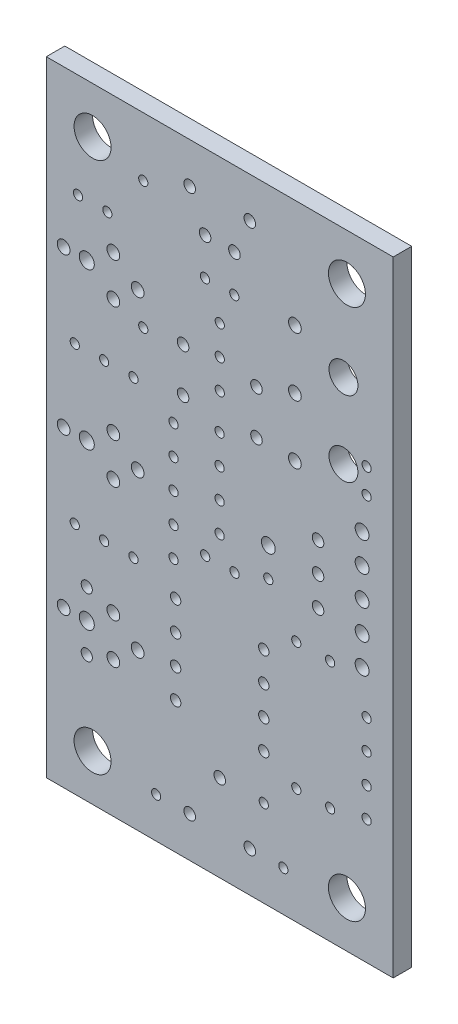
from build123d import *

# Parameters (mm, degrees)
ESQUISSE1_W      = 29.99994
ESQUISSE1_H      = 54.0004
ESQUISSE1_R      = 0.50038
ESQUISSE1_R_2    = 0.4826
ESQUISSE1_R_3    = 0.39878
ESQUISSE1_R_4    = 0.55118
ESQUISSE1_R_5    = 0.65024
ESQUISSE1_R_6    = 1.6002
ESQUISSE1_R_7    = 0.44958
ESQUISSE1_R_8    = 1.24968
ESQUISSE1_R_9    = 0.59944
ESQUISSE1_R_10   = 0.5
ESQUISSE1_R_11   = 0.4
EXTRUSION1_DEPTH = 1.6


with BuildPart() as part:
    # Esquisse1 → Extrusion1 (new body)
    with BuildSketch(Plane.XY):
        with Locations((14.99997, 27.0002)):
            Rectangle(ESQUISSE1_W, ESQUISSE1_H)
        with Locations((18.17624, 38.36416)):
            Circle(ESQUISSE1_R, mode=Mode.SUBTRACT)
        with Locations((18.17624, 34.55416)):
            Circle(ESQUISSE1_R, mode=Mode.SUBTRACT)
        with Locations((11.82624, 34.55416)):
            Circle(ESQUISSE1_R, mode=Mode.SUBTRACT)
        with Locations((11.82624, 38.36416)):
            Circle(ESQUISSE1_R, mode=Mode.SUBTRACT)
        with Locations((17.59966, 3.50012)):
            Circle(ESQUISSE1_R, mode=Mode.SUBTRACT)
        with Locations((12.40028, 3.50012)):
            Circle(ESQUISSE1_R, mode=Mode.SUBTRACT)
        with Locations((12.40028, 50.50028)):
            Circle(ESQUISSE1_R, mode=Mode.SUBTRACT)
        with Locations((17.59966, 50.50028)):
            Circle(ESQUISSE1_R, mode=Mode.SUBTRACT)
        with Locations((3.50012, 10.9601)):
            Circle(ESQUISSE1_R_2, mode=Mode.SUBTRACT)
        with Locations((3.50012, 16.0401)):
            Circle(ESQUISSE1_R_2, mode=Mode.SUBTRACT)
        with Locations((14.98854, 30.82036)):
            Circle(ESQUISSE1_R_3, mode=Mode.SUBTRACT)
        with Locations((14.98854, 33.36036)):
            Circle(ESQUISSE1_R_3, mode=Mode.SUBTRACT)
        with Locations((16.27124, 47.50054)):
            Circle(ESQUISSE1_R, mode=Mode.SUBTRACT)
        with Locations((13.73124, 47.50054)):
            Circle(ESQUISSE1_R, mode=Mode.SUBTRACT)
        with Locations((27.70124, 13.28928)):
            Circle(ESQUISSE1_R_3, mode=Mode.SUBTRACT)
        with Locations((27.70124, 10.74928)):
            Circle(ESQUISSE1_R_3, mode=Mode.SUBTRACT)
        with Locations((1.4986, 13.5001)):
            Circle(ESQUISSE1_R_4, mode=Mode.SUBTRACT)
        with Locations((7.8994, 13.5001)):
            Circle(ESQUISSE1_R_4, mode=Mode.SUBTRACT)
        with Locations((5.79882, 11.75004)):
            Circle(ESQUISSE1_R_4, mode=Mode.SUBTRACT)
        with Locations((5.79882, 15.25016)):
            Circle(ESQUISSE1_R_4, mode=Mode.SUBTRACT)
        with Locations((3.50012, 13.5001)):
            Circle(ESQUISSE1_R_5, mode=Mode.SUBTRACT)
        with Locations((1.4986, 27.0002)):
            Circle(ESQUISSE1_R_4, mode=Mode.SUBTRACT)
        with Locations((7.8994, 27.0002)):
            Circle(ESQUISSE1_R_4, mode=Mode.SUBTRACT)
        with Locations((5.79882, 25.25014)):
            Circle(ESQUISSE1_R_4, mode=Mode.SUBTRACT)
        with Locations((5.79882, 28.75026)):
            Circle(ESQUISSE1_R_4, mode=Mode.SUBTRACT)
        with Locations((3.50012, 27.0002)):
            Circle(ESQUISSE1_R_5, mode=Mode.SUBTRACT)
        with Locations((1.4986, 40.5003)):
            Circle(ESQUISSE1_R_4, mode=Mode.SUBTRACT)
        with Locations((7.8994, 40.5003)):
            Circle(ESQUISSE1_R_4, mode=Mode.SUBTRACT)
        with Locations((5.79882, 38.75024)):
            Circle(ESQUISSE1_R_4, mode=Mode.SUBTRACT)
        with Locations((5.79882, 42.25036)):
            Circle(ESQUISSE1_R_4, mode=Mode.SUBTRACT)
        with Locations((3.50012, 40.5003)):
            Circle(ESQUISSE1_R_5, mode=Mode.SUBTRACT)
        with Locations((15.00124, 36.45916)):
            Circle(ESQUISSE1_R_3, mode=Mode.SUBTRACT)
        with Locations((15.00124, 41.53916)):
            Circle(ESQUISSE1_R_3, mode=Mode.SUBTRACT)
        with Locations((4.0005, 49.9999)):
            Circle(ESQUISSE1_R_6, mode=Mode.SUBTRACT)
        with Locations((25.99944, 49.9999)):
            Circle(ESQUISSE1_R_6, mode=Mode.SUBTRACT)
        with Locations((4.0005, 4.0005)):
            Circle(ESQUISSE1_R_6, mode=Mode.SUBTRACT)
        with Locations((25.99944, 4.0005)):
            Circle(ESQUISSE1_R_6, mode=Mode.SUBTRACT)
        with Locations((18.80616, 11.38428)):
            Circle(ESQUISSE1_R_7, mode=Mode.SUBTRACT)
        with Locations((18.80616, 13.92428)):
            Circle(ESQUISSE1_R_7, mode=Mode.SUBTRACT)
        with Locations((18.80616, 16.46428)):
            Circle(ESQUISSE1_R_7, mode=Mode.SUBTRACT)
        with Locations((18.80616, 19.00428)):
            Circle(ESQUISSE1_R_7, mode=Mode.SUBTRACT)
        with Locations((11.18616, 19.00428)):
            Circle(ESQUISSE1_R_7, mode=Mode.SUBTRACT)
        with Locations((11.18616, 16.46428)):
            Circle(ESQUISSE1_R_7, mode=Mode.SUBTRACT)
        with Locations((11.18616, 13.92428)):
            Circle(ESQUISSE1_R_7, mode=Mode.SUBTRACT)
        with Locations((11.18616, 11.38428)):
            Circle(ESQUISSE1_R_7, mode=Mode.SUBTRACT)
        with Locations((2.46126, 33.74898)):
            Circle(ESQUISSE1_R_3, mode=Mode.SUBTRACT)
        with Locations((5.00126, 33.74898)):
            Circle(ESQUISSE1_R_3, mode=Mode.SUBTRACT)
        with Locations((7.54126, 33.74898)):
            Circle(ESQUISSE1_R_3, mode=Mode.SUBTRACT)
        with Locations((2.46126, 20.24888)):
            Circle(ESQUISSE1_R_3, mode=Mode.SUBTRACT)
        with Locations((5.00126, 20.24888)):
            Circle(ESQUISSE1_R_3, mode=Mode.SUBTRACT)
        with Locations((7.54126, 20.24888)):
            Circle(ESQUISSE1_R_3, mode=Mode.SUBTRACT)
        with Locations((5.28066, 45.01134)):
            Circle(ESQUISSE1_R_3, mode=Mode.SUBTRACT)
        with Locations((2.74066, 45.01134)):
            Circle(ESQUISSE1_R_3, mode=Mode.SUBTRACT)
        with Locations((14.98854, 28.28036)):
            Circle(ESQUISSE1_R_3, mode=Mode.SUBTRACT)
        with Locations((14.98854, 25.74036)):
            Circle(ESQUISSE1_R_3, mode=Mode.SUBTRACT)
        with Locations((16.2814, 23.51024)):
            Circle(ESQUISSE1_R_3, mode=Mode.SUBTRACT)
        with Locations((13.7414, 23.51024)):
            Circle(ESQUISSE1_R_3, mode=Mode.SUBTRACT)
        with Locations((13.71854, 44.28744)):
            Circle(ESQUISSE1_R_3, mode=Mode.SUBTRACT)
        with Locations((16.25854, 44.28744)):
            Circle(ESQUISSE1_R_3, mode=Mode.SUBTRACT)
        with Locations((21.49856, 44.63542)):
            Circle(ESQUISSE1_R_4, mode=Mode.SUBTRACT)
        with Locations((21.49856, 39.55288)):
            Circle(ESQUISSE1_R_4, mode=Mode.SUBTRACT)
        with Locations((21.49856, 34.47288)):
            Circle(ESQUISSE1_R_4, mode=Mode.SUBTRACT)
        with Locations((25.69718, 42.84218)):
            Circle(ESQUISSE1_R_8, mode=Mode.SUBTRACT)
        with Locations((25.69718, 36.34232)):
            Circle(ESQUISSE1_R_8, mode=Mode.SUBTRACT)
        with Locations((23.50008, 29.5402)):
            Circle(ESQUISSE1_R, mode=Mode.SUBTRACT)
        with Locations((23.50008, 27.0002)):
            Circle(ESQUISSE1_R, mode=Mode.SUBTRACT)
        with Locations((23.50008, 24.4602)):
            Circle(ESQUISSE1_R, mode=Mode.SUBTRACT)
        with Locations((20.50034, 3.50012)):
            Circle(ESQUISSE1_R_3, mode=Mode.SUBTRACT)
        with Locations((9.4996, 3.50012)):
            Circle(ESQUISSE1_R_3, mode=Mode.SUBTRACT)
        with Locations((8.38454, 48.90262)):
            Circle(ESQUISSE1_R_3, mode=Mode.SUBTRACT)
        with Locations((8.38454, 37.90188)):
            Circle(ESQUISSE1_R_3, mode=Mode.SUBTRACT)
        with Locations((21.62048, 9.99998)):
            Circle(ESQUISSE1_R_3, mode=Mode.SUBTRACT)
        with Locations((21.62048, 21.00072)):
            Circle(ESQUISSE1_R_3, mode=Mode.SUBTRACT)
        with Locations((24.54402, 9.99998)):
            Circle(ESQUISSE1_R_3, mode=Mode.SUBTRACT)
        with Locations((24.54402, 21.00072)):
            Circle(ESQUISSE1_R_3, mode=Mode.SUBTRACT)
        with Locations((27.70124, 15.82928)):
            Circle(ESQUISSE1_R_3, mode=Mode.SUBTRACT)
        with Locations((27.70124, 37.1602)):
            Circle(ESQUISSE1_R_3, mode=Mode.SUBTRACT)
        with Locations((27.70124, 18.36928)):
            Circle(ESQUISSE1_R_3, mode=Mode.SUBTRACT)
        with Locations((27.70124, 35.0012)):
            Circle(ESQUISSE1_R_3, mode=Mode.SUBTRACT)
        with Locations((27.31008, 27.0002)):
            Circle(ESQUISSE1_R_9, mode=Mode.SUBTRACT)
        with Locations((27.31008, 29.5402)):
            Circle(ESQUISSE1_R_9, mode=Mode.SUBTRACT)
        with Locations((27.31008, 32.0802)):
            Circle(ESQUISSE1_R_9, mode=Mode.SUBTRACT)
        with Locations((27.31008, 24.4602)):
            Circle(ESQUISSE1_R_9, mode=Mode.SUBTRACT)
        with Locations((27.31008, 21.9202)):
            Circle(ESQUISSE1_R_9, mode=Mode.SUBTRACT)
        with Locations((19.19986, 27.0002)):
            Circle(ESQUISSE1_R_9, mode=Mode.SUBTRACT)
        with Locations((19.19986, 24.50084)):
            Circle(ESQUISSE1_R_3, mode=Mode.SUBTRACT)
        with Locations((11.00328, 32.07004)):
            Circle(ESQUISSE1_R_3, mode=Mode.SUBTRACT)
        with Locations((11.00328, 29.53004)):
            Circle(ESQUISSE1_R_3, mode=Mode.SUBTRACT)
        with Locations((11.00328, 26.99004)):
            Circle(ESQUISSE1_R_3, mode=Mode.SUBTRACT)
        with Locations((11.00328, 24.45004)):
            Circle(ESQUISSE1_R_3, mode=Mode.SUBTRACT)
        with Locations((11.00328, 21.91004)):
            Circle(ESQUISSE1_R_3, mode=Mode.SUBTRACT)
        with Locations((15.00124, 38.99916)):
            Circle(ESQUISSE1_R_3, mode=Mode.SUBTRACT)
        with Locations((14.99997, 7.50012)):
            Circle(ESQUISSE1_R_10, mode=Mode.SUBTRACT)
        with Locations((18.80997, 7.50012)):
            Circle(ESQUISSE1_R_11, mode=Mode.SUBTRACT)
    extrude(amount=EXTRUSION1_DEPTH)


solid = part.part
